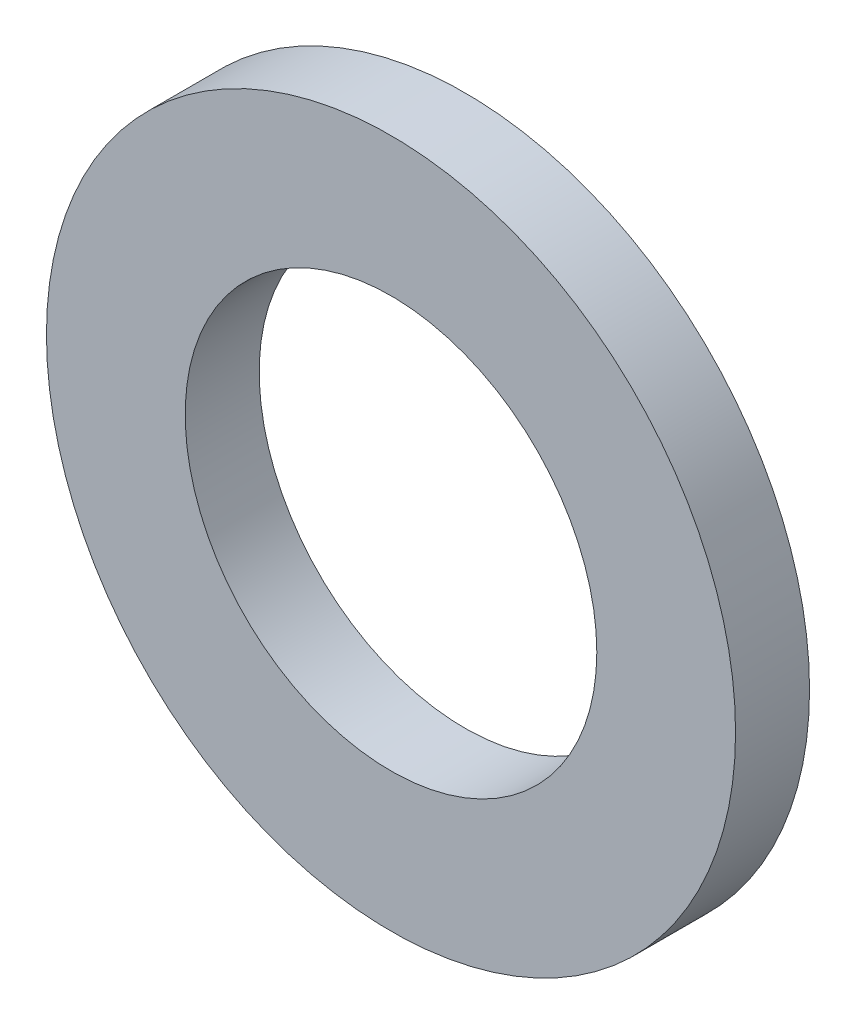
ISO-10303-21;
HEADER;
FILE_DESCRIPTION(('STEP AP214'),'2;1');
FILE_NAME('part.step','',(''),(''),'','','');
FILE_SCHEMA(('AUTOMOTIVE_DESIGN { 1 0 10303 214 1 1 1 1 }'));
ENDSEC;
DATA;
#1=APPLICATION_CONTEXT('core data for automotive mechanical design processes');
#2=APPLICATION_PROTOCOL_DEFINITION('international standard','automotive_design',2000,#1);
#3=PRODUCT_CONTEXT('',#1,'mechanical');
#4=PRODUCT('Part','Part','',(#3));
#5=PRODUCT_RELATED_PRODUCT_CATEGORY('part','',(#4));
#6=PRODUCT_DEFINITION_FORMATION('','',#4);
#7=PRODUCT_DEFINITION_CONTEXT('part definition',#1,'design');
#8=PRODUCT_DEFINITION('design','',#6,#7);
#9=PRODUCT_DEFINITION_SHAPE('','',#8);
#10=(LENGTH_UNIT() NAMED_UNIT(*) SI_UNIT(.MILLI.,.METRE.));
#11=(NAMED_UNIT(*) PLANE_ANGLE_UNIT() SI_UNIT($,.RADIAN.));
#12=(NAMED_UNIT(*) SI_UNIT($,.STERADIAN.) SOLID_ANGLE_UNIT());
#13=UNCERTAINTY_MEASURE_WITH_UNIT(LENGTH_MEASURE(1.E-05),#10,'distance_accuracy_value','');
#14=(GEOMETRIC_REPRESENTATION_CONTEXT(3) GLOBAL_UNCERTAINTY_ASSIGNED_CONTEXT((#13)) GLOBAL_UNIT_ASSIGNED_CONTEXT((#10,
#11,#12)) REPRESENTATION_CONTEXT('',''));
#15=CARTESIAN_POINT('',(0.,0.,0.));
#16=DIRECTION('',(0.,0.,1.));
#17=DIRECTION('',(1.,0.,0.));
#18=AXIS2_PLACEMENT_3D('',#15,#16,#17);
#19=CARTESIAN_POINT('',(0.,0.,0.4064));
#20=DIRECTION('',(0.,0.,1.));
#21=DIRECTION('',(1.,0.,0.));
#22=AXIS2_PLACEMENT_3D('',#19,#20,#21);
#23=PLANE('',#22);
#24=CARTESIAN_POINT('',(0.,0.,0.4064));
#25=DIRECTION('',(0.,0.,1.));
#26=DIRECTION('',(1.,0.,0.));
#27=AXIS2_PLACEMENT_3D('',#24,#25,#26);
#28=CIRCLE('',#27,1.1303);
#29=CARTESIAN_POINT('',(1.1303,0.,0.4064));
#30=VERTEX_POINT('',#29);
#31=EDGE_CURVE('E26',#30,#30,#28,.F.);
#32=ORIENTED_EDGE('',*,*,#31,.T.);
#33=EDGE_LOOP('',(#32));
#34=FACE_BOUND('',#33,.T.);
#35=CARTESIAN_POINT('',(0.,0.,0.4064));
#36=DIRECTION('',(0.,0.,1.));
#37=DIRECTION('',(1.,0.,0.));
#38=AXIS2_PLACEMENT_3D('',#35,#36,#37);
#39=CIRCLE('',#38,1.8923);
#40=CARTESIAN_POINT('',(1.8923,0.,0.4064));
#41=VERTEX_POINT('',#40);
#42=EDGE_CURVE('E17',#41,#41,#39,.F.);
#43=ORIENTED_EDGE('',*,*,#42,.F.);
#44=EDGE_LOOP('',(#43));
#45=FACE_BOUND('',#44,.T.);
#46=ADVANCED_FACE('F14',(#34,#45),#23,.T.);
#47=CARTESIAN_POINT('',(0.,0.,0.));
#48=DIRECTION('',(0.,0.,1.));
#49=DIRECTION('',(1.,0.,0.));
#50=AXIS2_PLACEMENT_3D('',#47,#48,#49);
#51=CYLINDRICAL_SURFACE('',#50,1.8923);
#52=ORIENTED_EDGE('',*,*,#42,.T.);
#53=EDGE_LOOP('',(#52));
#54=FACE_BOUND('',#53,.T.);
#55=CARTESIAN_POINT('',(0.,0.,0.));
#56=DIRECTION('',(0.,0.,1.));
#57=DIRECTION('',(1.,0.,0.));
#58=AXIS2_PLACEMENT_3D('',#55,#56,#57);
#59=CIRCLE('',#58,1.8923);
#60=CARTESIAN_POINT('',(1.8923,0.,0.));
#61=VERTEX_POINT('',#60);
#62=EDGE_CURVE('E21',#61,#61,#59,.T.);
#63=ORIENTED_EDGE('',*,*,#62,.T.);
#64=EDGE_LOOP('',(#63));
#65=FACE_BOUND('',#64,.T.);
#66=ADVANCED_FACE('F34',(#54,#65),#51,.T.);
#67=CARTESIAN_POINT('',(0.,0.,0.));
#68=DIRECTION('',(0.,0.,1.));
#69=DIRECTION('',(1.,0.,0.));
#70=AXIS2_PLACEMENT_3D('',#67,#68,#69);
#71=CYLINDRICAL_SURFACE('',#70,1.1303);
#72=ORIENTED_EDGE('',*,*,#31,.F.);
#73=EDGE_LOOP('',(#72));
#74=FACE_BOUND('',#73,.T.);
#75=CARTESIAN_POINT('',(0.,0.,0.));
#76=DIRECTION('',(0.,0.,1.));
#77=DIRECTION('',(1.,0.,0.));
#78=AXIS2_PLACEMENT_3D('',#75,#76,#77);
#79=CIRCLE('',#78,1.1303);
#80=CARTESIAN_POINT('',(1.1303,0.,0.));
#81=VERTEX_POINT('',#80);
#82=EDGE_CURVE('E10',#81,#81,#79,.F.);
#83=ORIENTED_EDGE('',*,*,#82,.T.);
#84=EDGE_LOOP('',(#83));
#85=FACE_BOUND('',#84,.T.);
#86=ADVANCED_FACE('F42',(#74,#85),#71,.F.);
#87=CARTESIAN_POINT('',(0.,0.,0.));
#88=DIRECTION('',(0.,0.,1.));
#89=DIRECTION('',(1.,0.,0.));
#90=AXIS2_PLACEMENT_3D('',#87,#88,#89);
#91=PLANE('',#90);
#92=ORIENTED_EDGE('',*,*,#82,.F.);
#93=EDGE_LOOP('',(#92));
#94=FACE_BOUND('',#93,.T.);
#95=ORIENTED_EDGE('',*,*,#62,.F.);
#96=EDGE_LOOP('',(#95));
#97=FACE_BOUND('',#96,.T.);
#98=ADVANCED_FACE('F43',(#94,#97),#91,.F.);
#99=CLOSED_SHELL('',(#46,#66,#86,#98));
#100=MANIFOLD_SOLID_BREP('B1',#99);
#101=ADVANCED_BREP_SHAPE_REPRESENTATION('',(#18,#100),#14);
#102=SHAPE_DEFINITION_REPRESENTATION(#9,#101);
ENDSEC;
END-ISO-10303-21;
